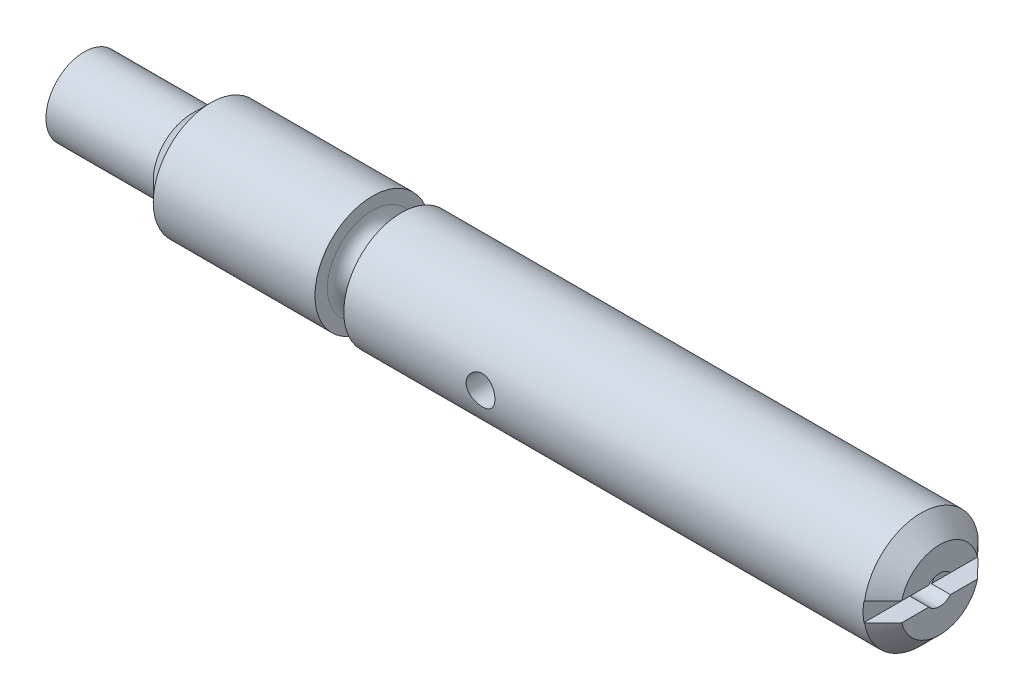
ISO-10303-21;
HEADER;
FILE_DESCRIPTION(('STEP AP214'),'2;1');
FILE_NAME('part.step','',(''),(''),'','','');
FILE_SCHEMA(('AUTOMOTIVE_DESIGN { 1 0 10303 214 1 1 1 1 }'));
ENDSEC;
DATA;
#1=APPLICATION_CONTEXT('core data for automotive mechanical design processes');
#2=APPLICATION_PROTOCOL_DEFINITION('international standard','automotive_design',2000,#1);
#3=PRODUCT_CONTEXT('',#1,'mechanical');
#4=PRODUCT('Part','Part','',(#3));
#5=PRODUCT_RELATED_PRODUCT_CATEGORY('part','',(#4));
#6=PRODUCT_DEFINITION_FORMATION('','',#4);
#7=PRODUCT_DEFINITION_CONTEXT('part definition',#1,'design');
#8=PRODUCT_DEFINITION('design','',#6,#7);
#9=PRODUCT_DEFINITION_SHAPE('','',#8);
#10=(LENGTH_UNIT() NAMED_UNIT(*) SI_UNIT(.MILLI.,.METRE.));
#11=(NAMED_UNIT(*) PLANE_ANGLE_UNIT() SI_UNIT($,.RADIAN.));
#12=(NAMED_UNIT(*) SI_UNIT($,.STERADIAN.) SOLID_ANGLE_UNIT());
#13=UNCERTAINTY_MEASURE_WITH_UNIT(LENGTH_MEASURE(1.E-05),#10,'distance_accuracy_value','');
#14=(GEOMETRIC_REPRESENTATION_CONTEXT(3) GLOBAL_UNCERTAINTY_ASSIGNED_CONTEXT((#13)) GLOBAL_UNIT_ASSIGNED_CONTEXT((#10,
#11,#12)) REPRESENTATION_CONTEXT('',''));
#15=CARTESIAN_POINT('',(0.,0.,0.));
#16=DIRECTION('',(0.,0.,1.));
#17=DIRECTION('',(1.,0.,0.));
#18=AXIS2_PLACEMENT_3D('',#15,#16,#17);
#19=CARTESIAN_POINT('',(71.628,0.,0.));
#20=DIRECTION('',(-1.,0.,0.));
#21=DIRECTION('',(0.,0.,1.));
#22=AXIS2_PLACEMENT_3D('',#19,#20,#21);
#23=CYLINDRICAL_SURFACE('',#22,4.7625);
#24=CARTESIAN_POINT('',(70.0532,0.,0.));
#25=DIRECTION('',(-1.,0.,0.));
#26=DIRECTION('',(0.,0.,1.));
#27=AXIS2_PLACEMENT_3D('',#24,#25,#26);
#28=CIRCLE('',#27,4.7625);
#29=CARTESIAN_POINT('',(70.0532,0.7874,-4.69695725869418));
#30=VERTEX_POINT('',#29);
#31=CARTESIAN_POINT('',(70.0532,-0.7874,-4.69695725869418));
#32=VERTEX_POINT('',#31);
#33=EDGE_CURVE('E594',#30,#32,#28,.T.);
#34=ORIENTED_EDGE('',*,*,#33,.T.);
#35=DIRECTION('',(-1.,0.,0.));
#36=VECTOR('',#35,1.);
#37=CARTESIAN_POINT('',(71.628,-0.7874,-4.69695725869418));
#38=LINE('',#37,#36);
#39=CARTESIAN_POINT('',(70.104,-0.7874,-4.6969572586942));
#40=VERTEX_POINT('',#39);
#41=EDGE_CURVE('E584',#32,#40,#38,.F.);
#42=ORIENTED_EDGE('',*,*,#41,.T.);
#43=CARTESIAN_POINT('',(70.104,0.,0.));
#44=DIRECTION('',(1.,0.,0.));
#45=DIRECTION('',(0.,0.,-1.));
#46=AXIS2_PLACEMENT_3D('',#43,#44,#45);
#47=CIRCLE('',#46,4.7625);
#48=CARTESIAN_POINT('',(70.104,-0.7874,4.69695725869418));
#49=VERTEX_POINT('',#48);
#50=EDGE_CURVE('E519',#40,#49,#47,.F.);
#51=ORIENTED_EDGE('',*,*,#50,.T.);
#52=DIRECTION('',(-1.,0.,0.));
#53=VECTOR('',#52,1.);
#54=CARTESIAN_POINT('',(71.628,-0.7874,4.69695725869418));
#55=LINE('',#54,#53);
#56=CARTESIAN_POINT('',(70.0532,-0.7874,4.69695725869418));
#57=VERTEX_POINT('',#56);
#58=EDGE_CURVE('E569',#49,#57,#55,.T.);
#59=ORIENTED_EDGE('',*,*,#58,.T.);
#60=CARTESIAN_POINT('',(70.0532,0.7874,4.69695725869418));
#61=VERTEX_POINT('',#60);
#62=EDGE_CURVE('E580',#57,#61,#28,.T.);
#63=ORIENTED_EDGE('',*,*,#62,.T.);
#64=DIRECTION('',(-1.,0.,0.));
#65=VECTOR('',#64,1.);
#66=CARTESIAN_POINT('',(71.628,0.7874,4.69695725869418));
#67=LINE('',#66,#65);
#68=CARTESIAN_POINT('',(70.104,0.7874,4.69695725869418));
#69=VERTEX_POINT('',#68);
#70=EDGE_CURVE('E617',#69,#61,#67,.T.);
#71=ORIENTED_EDGE('',*,*,#70,.F.);
#72=CARTESIAN_POINT('',(70.104,0.7874,-4.69695725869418));
#73=VERTEX_POINT('',#72);
#74=EDGE_CURVE('E515',#69,#73,#47,.F.);
#75=ORIENTED_EDGE('',*,*,#74,.T.);
#76=DIRECTION('',(-1.,0.,0.));
#77=VECTOR('',#76,1.);
#78=CARTESIAN_POINT('',(71.628,0.7874,-4.69695725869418));
#79=LINE('',#78,#77);
#80=EDGE_CURVE('E602',#30,#73,#79,.F.);
#81=ORIENTED_EDGE('',*,*,#80,.F.);
#82=EDGE_LOOP('',(#34,#42,#51,#59,#63,#71,#75,#81));
#83=FACE_BOUND('',#82,.T.);
#84=CARTESIAN_POINT('',(27.0256,0.,0.));
#85=DIRECTION('',(1.,0.,0.));
#86=DIRECTION('',(0.,0.,-1.));
#87=AXIS2_PLACEMENT_3D('',#84,#85,#86);
#88=CIRCLE('',#87,4.7625);
#89=CARTESIAN_POINT('',(27.0256,0.,-4.7625));
#90=VERTEX_POINT('',#89);
#91=EDGE_CURVE('E627',#90,#90,#88,.T.);
#92=ORIENTED_EDGE('',*,*,#91,.T.);
#93=EDGE_LOOP('',(#92));
#94=FACE_BOUND('',#93,.T.);
#95=CARTESIAN_POINT('',(39.5478,0.,4.7625));
#96=CARTESIAN_POINT('',(39.5477981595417,0.0659525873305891,4.762498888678));
#97=CARTESIAN_POINT('',(39.5423161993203,0.131925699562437,4.76111635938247));
#98=CARTESIAN_POINT('',(39.5205662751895,0.261980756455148,4.7557351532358));
#99=CARTESIAN_POINT('',(39.5042922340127,0.326061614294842,4.75173500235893));
#100=CARTESIAN_POINT('',(39.4615134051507,0.450435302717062,4.74156145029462));
#101=CARTESIAN_POINT('',(39.4350209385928,0.510732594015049,4.73539066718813));
#102=CARTESIAN_POINT('',(39.3726007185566,0.626027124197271,4.72153284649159));
#103=CARTESIAN_POINT('',(39.3366726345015,0.681024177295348,4.71384575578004));
#104=CARTESIAN_POINT('',(39.2556156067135,0.785295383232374,4.6976117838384));
#105=CARTESIAN_POINT('',(39.2103281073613,0.834444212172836,4.68905158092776));
#106=CARTESIAN_POINT('',(39.1121772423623,0.924534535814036,4.67212456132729));
#107=CARTESIAN_POINT('',(39.059313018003,0.965475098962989,4.66375776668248));
#108=CARTESIAN_POINT('',(38.9465351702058,1.03857699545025,4.64803049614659));
#109=CARTESIAN_POINT('',(38.8865280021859,1.07059798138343,4.64068692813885));
#110=CARTESIAN_POINT('',(38.7617686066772,1.12404915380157,4.62803191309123));
#111=CARTESIAN_POINT('',(38.6970171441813,1.14548104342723,4.62272013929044));
#112=CARTESIAN_POINT('',(38.565985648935,1.1767178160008,4.61486707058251));
#113=CARTESIAN_POINT('',(38.4997626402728,1.18674810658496,4.61227214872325));
#114=CARTESIAN_POINT('',(38.3665269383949,1.19559909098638,4.60998608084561));
#115=CARTESIAN_POINT('',(38.2995143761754,1.19442161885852,4.6102944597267));
#116=CARTESIAN_POINT('',(38.1683306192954,1.18107031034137,4.61373195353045));
#117=CARTESIAN_POINT('',(38.1041299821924,1.16916523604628,4.61679212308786));
#118=CARTESIAN_POINT('',(37.9786675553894,1.13512546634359,4.62527849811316));
#119=CARTESIAN_POINT('',(37.9174059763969,1.11299003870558,4.63070487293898));
#120=CARTESIAN_POINT('',(37.798840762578,1.05888925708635,4.64337542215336));
#121=CARTESIAN_POINT('',(37.7415835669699,1.02682649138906,4.65063747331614));
#122=CARTESIAN_POINT('',(37.6331658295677,0.953849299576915,4.66615105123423));
#123=CARTESIAN_POINT('',(37.582006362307,0.912933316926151,4.67440275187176));
#124=CARTESIAN_POINT('',(37.4856963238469,0.822019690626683,4.69125603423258));
#125=CARTESIAN_POINT('',(37.4407601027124,0.771795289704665,4.69986086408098));
#126=CARTESIAN_POINT('',(37.3599071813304,0.664420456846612,4.71623754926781));
#127=CARTESIAN_POINT('',(37.3239907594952,0.607269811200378,4.72400937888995));
#128=CARTESIAN_POINT('',(37.2621176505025,0.487357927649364,4.73788340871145));
#129=CARTESIAN_POINT('',(37.2361959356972,0.424577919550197,4.74397972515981));
#130=CARTESIAN_POINT('',(37.1953338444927,0.295364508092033,4.75377305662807));
#131=CARTESIAN_POINT('',(37.1803913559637,0.228931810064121,4.75747053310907));
#132=CARTESIAN_POINT('',(37.1622395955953,0.0961313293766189,4.76198123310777));
#133=CARTESIAN_POINT('',(37.1587384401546,0.0298058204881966,4.76286619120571));
#134=CARTESIAN_POINT('',(37.1627679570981,-0.102483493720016,4.7618565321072));
#135=CARTESIAN_POINT('',(37.1702976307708,-0.168447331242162,4.75996216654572));
#136=CARTESIAN_POINT('',(37.1959345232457,-0.297125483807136,4.75365269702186));
#137=CARTESIAN_POINT('',(37.2138823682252,-0.359873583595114,4.74927559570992));
#138=CARTESIAN_POINT('',(37.2596639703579,-0.481464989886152,4.73849413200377));
#139=CARTESIAN_POINT('',(37.2874987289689,-0.540307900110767,4.73208956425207));
#140=CARTESIAN_POINT('',(37.3528287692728,-0.653578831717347,4.7177919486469));
#141=CARTESIAN_POINT('',(37.3904873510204,-0.707909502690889,4.70987441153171));
#142=CARTESIAN_POINT('',(37.4741874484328,-0.809583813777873,4.69346749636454));
#143=CARTESIAN_POINT('',(37.520230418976,-0.856926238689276,4.68497801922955));
#144=CARTESIAN_POINT('',(37.6207477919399,-0.944484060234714,4.66812560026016));
#145=CARTESIAN_POINT('',(37.6754022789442,-0.984494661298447,4.65977095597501));
#146=CARTESIAN_POINT('',(37.7908217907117,-1.0547763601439,4.6443678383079));
#147=CARTESIAN_POINT('',(37.8515865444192,-1.08504788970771,4.63731930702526));
#148=CARTESIAN_POINT('',(37.977176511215,-1.13476659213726,4.62540430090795));
#149=CARTESIAN_POINT('',(38.0419750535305,-1.15427788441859,4.62052493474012));
#150=CARTESIAN_POINT('',(38.1740738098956,-1.1820906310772,4.61348866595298));
#151=CARTESIAN_POINT('',(38.2413734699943,-1.19039455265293,4.61133116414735));
#152=CARTESIAN_POINT('',(38.3744795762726,-1.19542741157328,4.61002874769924));
#153=CARTESIAN_POINT('',(38.4402730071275,-1.19248374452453,4.61079861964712));
#154=CARTESIAN_POINT('',(38.5703932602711,-1.1758546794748,4.61506709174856));
#155=CARTESIAN_POINT('',(38.6347201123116,-1.16216949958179,4.61856563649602));
#156=CARTESIAN_POINT('',(38.7597230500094,-1.12462513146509,4.62784963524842));
#157=CARTESIAN_POINT('',(38.8204187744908,-1.10082765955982,4.63362120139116));
#158=CARTESIAN_POINT('',(38.9369995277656,-1.04378302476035,4.64680281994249));
#159=CARTESIAN_POINT('',(38.9928838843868,-1.0105345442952,4.65421310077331));
#160=CARTESIAN_POINT('',(39.0998368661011,-0.934506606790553,4.67007994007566));
#161=CARTESIAN_POINT('',(39.1507408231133,-0.891500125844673,4.67855883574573));
#162=CARTESIAN_POINT('',(39.2447159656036,-0.797618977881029,4.69547453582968));
#163=CARTESIAN_POINT('',(39.287785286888,-0.74674244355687,4.70391132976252));
#164=CARTESIAN_POINT('',(39.3656345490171,-0.637445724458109,4.71997581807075));
#165=CARTESIAN_POINT('',(39.4002490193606,-0.57890490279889,4.72758595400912));
#166=CARTESIAN_POINT('',(39.4590902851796,-0.456649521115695,4.74095416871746));
#167=CARTESIAN_POINT('',(39.483324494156,-0.392938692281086,4.74671356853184));
#168=CARTESIAN_POINT('',(39.5171369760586,-0.274455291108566,4.75488407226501));
#169=CARTESIAN_POINT('',(39.5286106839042,-0.220245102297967,4.75772038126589));
#170=CARTESIAN_POINT('',(39.5439426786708,-0.110694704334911,4.76152874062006));
#171=CARTESIAN_POINT('',(39.5478015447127,-0.0553545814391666,4.76250093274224));
#172=CARTESIAN_POINT('',(39.5478,0.,4.7625));
#173=B_SPLINE_CURVE_WITH_KNOTS('',3,(#95,#96,#97,#98,#99,#100,#101,#102,#103,#104,#105,#106,
#107,#108,#109,#110,#111,#112,#113,#114,#115,#116,#117,#118,#119,#120,#121,#122,#123,#124,#125,
#126,#127,#128,#129,#130,#131,#132,#133,#134,#135,#136,#137,#138,#139,#140,#141,#142,#143,#144,
#145,#146,#147,#148,#149,#150,#151,#152,#153,#154,#155,#156,#157,#158,#159,#160,#161,#162,#163,
#164,#165,#166,#167,#168,#169,#170,#171,#172),.UNSPECIFIED.,.T.,.F.,(4,2,2,2,2,2,2,2,2,2,2,2,2,
2,2,2,2,2,2,2,2,2,2,2,2,2,2,2,2,2,2,2,2,2,2,2,2,2,4),(0.,0.197654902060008,0.395421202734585,
0.592949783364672,0.790485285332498,0.991691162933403,1.19291986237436,1.39715587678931,
1.60135903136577,1.80145080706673,2.00150984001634,2.19669196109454,2.39188805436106,
2.58906369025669,2.78627402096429,2.98913889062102,3.19201002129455,3.3955847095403,
3.59912022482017,3.79742099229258,3.99570380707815,4.19103043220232,4.38637684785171,
4.58520407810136,4.78406584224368,4.98783686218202,5.19159884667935,5.39413313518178,
5.59662283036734,5.7932639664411,5.9899011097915,6.18535501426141,6.3808361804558,
6.58144235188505,6.78209619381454,6.98640880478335,7.19057525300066,7.35648135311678,
7.52237483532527),.UNSPECIFIED.);
#174=CARTESIAN_POINT('',(39.5478,0.,4.7625));
#175=VERTEX_POINT('',#174);
#176=EDGE_CURVE('E655',#175,#175,#173,.T.);
#177=ORIENTED_EDGE('',*,*,#176,.F.);
#178=EDGE_LOOP('',(#177));
#179=FACE_BOUND('',#178,.T.);
#180=ADVANCED_FACE('F381',(#83,#94,#179),#23,.T.);
#181=CARTESIAN_POINT('',(71.628,0.,0.));
#182=DIRECTION('',(1.,0.,0.));
#183=DIRECTION('',(0.,0.,-1.));
#184=AXIS2_PLACEMENT_3D('',#181,#182,#183);
#185=CYLINDRICAL_SURFACE('',#184,1.19379999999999);
#186=CARTESIAN_POINT('',(34.798,0.,0.));
#187=DIRECTION('',(1.,0.,0.));
#188=DIRECTION('',(0.,0.,-1.));
#189=AXIS2_PLACEMENT_3D('',#186,#187,#188);
#190=CIRCLE('',#189,1.19379999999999);
#191=CARTESIAN_POINT('',(34.798,0.,-1.19379999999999));
#192=VERTEX_POINT('',#191);
#193=EDGE_CURVE('E595',#192,#192,#190,.T.);
#194=ORIENTED_EDGE('',*,*,#193,.F.);
#195=EDGE_LOOP('',(#194));
#196=FACE_BOUND('',#195,.T.);
#197=CARTESIAN_POINT('',(71.628,0.,0.));
#198=DIRECTION('',(1.,0.,0.));
#199=DIRECTION('',(0.,0.,-1.));
#200=AXIS2_PLACEMENT_3D('',#197,#198,#199);
#201=CIRCLE('',#200,1.1938);
#202=CARTESIAN_POINT('',(71.628,-0.7874,0.8973069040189));
#203=VERTEX_POINT('',#202);
#204=CARTESIAN_POINT('',(71.628,-0.7874,-0.8973069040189));
#205=VERTEX_POINT('',#204);
#206=EDGE_CURVE('E597',#203,#205,#201,.T.);
#207=ORIENTED_EDGE('',*,*,#206,.T.);
#208=DIRECTION('',(1.,0.,0.));
#209=VECTOR('',#208,1.);
#210=CARTESIAN_POINT('',(71.628,-0.7874,-0.8973069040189));
#211=LINE('',#210,#209);
#212=CARTESIAN_POINT('',(70.0532,-0.7874,-0.8973069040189));
#213=VERTEX_POINT('',#212);
#214=EDGE_CURVE('E586',#205,#213,#211,.F.);
#215=ORIENTED_EDGE('',*,*,#214,.T.);
#216=CARTESIAN_POINT('',(70.0532,0.,0.));
#217=DIRECTION('',(-1.,0.,0.));
#218=DIRECTION('',(0.,0.,1.));
#219=AXIS2_PLACEMENT_3D('',#216,#217,#218);
#220=CIRCLE('',#219,1.19379999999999);
#221=CARTESIAN_POINT('',(70.0532,0.7874,-0.8973069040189));
#222=VERTEX_POINT('',#221);
#223=EDGE_CURVE('E610',#213,#222,#220,.F.);
#224=ORIENTED_EDGE('',*,*,#223,.T.);
#225=DIRECTION('',(1.,0.,0.));
#226=VECTOR('',#225,1.);
#227=CARTESIAN_POINT('',(71.628,0.7874,-0.8973069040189));
#228=LINE('',#227,#226);
#229=CARTESIAN_POINT('',(71.628,0.7874,-0.8973069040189));
#230=VERTEX_POINT('',#229);
#231=EDGE_CURVE('E588',#230,#222,#228,.F.);
#232=ORIENTED_EDGE('',*,*,#231,.F.);
#233=CARTESIAN_POINT('',(71.628,0.7874,0.8973069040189));
#234=VERTEX_POINT('',#233);
#235=EDGE_CURVE('E522',#230,#234,#201,.T.);
#236=ORIENTED_EDGE('',*,*,#235,.T.);
#237=DIRECTION('',(1.,0.,0.));
#238=VECTOR('',#237,1.);
#239=CARTESIAN_POINT('',(71.628,0.7874,0.8973069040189));
#240=LINE('',#239,#238);
#241=CARTESIAN_POINT('',(70.0532,0.7874,0.8973069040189));
#242=VERTEX_POINT('',#241);
#243=EDGE_CURVE('E619',#242,#234,#240,.T.);
#244=ORIENTED_EDGE('',*,*,#243,.F.);
#245=CARTESIAN_POINT('',(70.0532,-0.7874,0.8973069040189));
#246=VERTEX_POINT('',#245);
#247=EDGE_CURVE('E622',#242,#246,#220,.F.);
#248=ORIENTED_EDGE('',*,*,#247,.T.);
#249=DIRECTION('',(1.,0.,0.));
#250=VECTOR('',#249,1.);
#251=CARTESIAN_POINT('',(71.628,-0.7874,0.8973069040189));
#252=LINE('',#251,#250);
#253=EDGE_CURVE('E572',#246,#203,#252,.T.);
#254=ORIENTED_EDGE('',*,*,#253,.T.);
#255=EDGE_LOOP('',(#207,#215,#224,#232,#236,#244,#248,#254));
#256=FACE_BOUND('',#255,.T.);
#257=CARTESIAN_POINT('',(38.354,0.,0.));
#258=DIRECTION('',(0.707106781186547,0.,-0.707106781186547));
#259=DIRECTION('',(0.707106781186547,0.,0.707106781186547));
#260=AXIS2_PLACEMENT_3D('',#257,#258,#259);
#261=ELLIPSE('',#260,1.688288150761,1.1938);
#262=CARTESIAN_POINT('',(38.354,1.19379999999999,0.));
#263=VERTEX_POINT('',#262);
#264=CARTESIAN_POINT('',(38.354,-1.19379999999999,0.));
#265=VERTEX_POINT('',#264);
#266=EDGE_CURVE('E11',#263,#265,#261,.T.);
#267=ORIENTED_EDGE('',*,*,#266,.F.);
#268=CARTESIAN_POINT('',(38.354,0.,0.));
#269=DIRECTION('',(0.707106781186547,0.,0.707106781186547));
#270=DIRECTION('',(0.707106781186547,0.,-0.707106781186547));
#271=AXIS2_PLACEMENT_3D('',#268,#269,#270);
#272=ELLIPSE('',#271,1.688288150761,1.1938);
#273=EDGE_CURVE('E389',#265,#263,#272,.F.);
#274=ORIENTED_EDGE('',*,*,#273,.F.);
#275=EDGE_LOOP('',(#267,#274));
#276=FACE_BOUND('',#275,.T.);
#277=ADVANCED_FACE('F466',(#196,#256,#276),#185,.F.);
#278=CARTESIAN_POINT('',(24.638,0.,0.));
#279=DIRECTION('',(-1.,0.,0.));
#280=DIRECTION('',(0.,0.,1.));
#281=AXIS2_PLACEMENT_3D('',#278,#279,#280);
#282=CIRCLE('',#281,4.7625);
#283=CARTESIAN_POINT('',(24.638,0.,4.7625));
#284=VERTEX_POINT('',#283);
#285=EDGE_CURVE('E630',#284,#284,#282,.T.);
#286=ORIENTED_EDGE('',*,*,#285,.T.);
#287=EDGE_LOOP('',(#286));
#288=FACE_BOUND('',#287,.T.);
#289=CARTESIAN_POINT('',(11.2395,0.,0.));
#290=DIRECTION('',(1.,0.,0.));
#291=DIRECTION('',(0.,0.,-1.));
#292=AXIS2_PLACEMENT_3D('',#289,#290,#291);
#293=CIRCLE('',#292,4.7625);
#294=CARTESIAN_POINT('',(11.2395,0.,-4.7625));
#295=VERTEX_POINT('',#294);
#296=EDGE_CURVE('E635',#295,#295,#293,.F.);
#297=ORIENTED_EDGE('',*,*,#296,.F.);
#298=EDGE_LOOP('',(#297));
#299=FACE_BOUND('',#298,.T.);
#300=ADVANCED_FACE('F468',(#288,#299),#23,.T.);
#301=CARTESIAN_POINT('',(71.628,0.,0.));
#302=DIRECTION('',(1.,0.,0.));
#303=DIRECTION('',(0.,0.,-1.));
#304=AXIS2_PLACEMENT_3D('',#301,#302,#303);
#305=PLANE('',#304);
#306=CARTESIAN_POINT('',(71.628,0.,0.));
#307=DIRECTION('',(1.,0.,0.));
#308=DIRECTION('',(0.,0.,-1.));
#309=AXIS2_PLACEMENT_3D('',#306,#307,#308);
#310=CIRCLE('',#309,3.2385);
#311=CARTESIAN_POINT('',(71.628,0.7874,-3.14131875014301));
#312=VERTEX_POINT('',#311);
#313=CARTESIAN_POINT('',(71.628,0.7874,3.14131875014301));
#314=VERTEX_POINT('',#313);
#315=EDGE_CURVE('E510',#312,#314,#310,.T.);
#316=ORIENTED_EDGE('',*,*,#315,.T.);
#317=DIRECTION('',(0.,0.,-1.));
#318=VECTOR('',#317,1.);
#319=CARTESIAN_POINT('',(71.628,0.7874,4.7625));
#320=LINE('',#319,#318);
#321=EDGE_CURVE('E401',#314,#234,#320,.T.);
#322=ORIENTED_EDGE('',*,*,#321,.T.);
#323=ORIENTED_EDGE('',*,*,#235,.F.);
#324=EDGE_CURVE('E513',#230,#312,#320,.T.);
#325=ORIENTED_EDGE('',*,*,#324,.T.);
#326=EDGE_LOOP('',(#316,#322,#323,#325));
#327=FACE_BOUND('',#326,.T.);
#328=ADVANCED_FACE('F476',(#327),#305,.T.);
#329=CARTESIAN_POINT('',(71.628,0.,0.));
#330=DIRECTION('',(-1.,0.,0.));
#331=DIRECTION('',(0.,0.,1.));
#332=AXIS2_PLACEMENT_3D('',#329,#330,#331);
#333=CONICAL_SURFACE('',#332,3.2385,0.785398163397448);
#334=ORIENTED_EDGE('',*,*,#74,.F.);
#335=CARTESIAN_POINT('',(64.3161102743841,0.7874,10.5209659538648));
#336=CARTESIAN_POINT('',(64.6872551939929,0.7874,10.1487740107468));
#337=CARTESIAN_POINT('',(65.0583536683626,0.7874,9.77653570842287));
#338=CARTESIAN_POINT('',(65.8004071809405,0.7874,9.03189082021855));
#339=CARTESIAN_POINT('',(66.1713622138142,0.7874,8.65948422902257));
#340=CARTESIAN_POINT('',(66.9133613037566,0.7874,7.91414285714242));
#341=CARTESIAN_POINT('',(67.2844051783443,0.7874,7.54120789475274));
#342=CARTESIAN_POINT('',(68.0261402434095,0.7874,6.79501200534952));
#343=CARTESIAN_POINT('',(68.3968314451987,0.7874,6.4217510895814));
#344=CARTESIAN_POINT('',(69.1223974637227,0.7874,5.69006996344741));
#345=CARTESIAN_POINT('',(69.4772946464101,0.7874,5.33167195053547));
#346=CARTESIAN_POINT('',(70.0089651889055,0.7874,4.79337198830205));
#347=CARTESIAN_POINT('',(70.1860850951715,0.7874,4.613812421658));
#348=CARTESIAN_POINT('',(70.5399927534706,0.7874,4.25436955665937));
#349=CARTESIAN_POINT('',(70.7167805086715,0.7874,4.07448626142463));
#350=CARTESIAN_POINT('',(71.0697857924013,0.7874,3.71433993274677));
#351=CARTESIAN_POINT('',(71.2460035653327,0.7874,3.53407713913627));
#352=CARTESIAN_POINT('',(71.5976983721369,0.7874,3.17281728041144));
#353=CARTESIAN_POINT('',(71.7731753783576,0.7874,2.9918201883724));
#354=CARTESIAN_POINT('',(72.122876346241,0.7874,2.62867535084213));
#355=CARTESIAN_POINT('',(72.2971005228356,0.7874,2.4465278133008));
#356=CARTESIAN_POINT('',(72.556686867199,0.7874,2.17166253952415));
#357=CARTESIAN_POINT('',(72.6429214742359,0.7874,2.07976952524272));
#358=CARTESIAN_POINT('',(72.8145340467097,0.7874,1.89518777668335));
#359=CARTESIAN_POINT('',(72.8999120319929,0.7874,1.80249906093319));
#360=CARTESIAN_POINT('',(73.0081387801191,0.7874,1.68333665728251));
#361=CARTESIAN_POINT('',(73.0315922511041,0.7874,1.65741205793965));
#362=CARTESIAN_POINT('',(73.078382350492,0.7874,1.60545753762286));
#363=CARTESIAN_POINT('',(73.1017189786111,0.7874,1.57942761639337));
#364=CARTESIAN_POINT('',(73.1715344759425,0.7874,1.50115544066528));
#365=CARTESIAN_POINT('',(73.2178146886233,0.7874,1.44873546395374));
#366=CARTESIAN_POINT('',(73.309975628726,0.7874,1.34292606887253));
#367=CARTESIAN_POINT('',(73.3558516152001,0.7874,1.28953251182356));
#368=CARTESIAN_POINT('',(73.4466047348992,0.7874,1.18192273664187));
#369=CARTESIAN_POINT('',(73.4914821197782,0.7874,1.12770673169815));
#370=CARTESIAN_POINT('',(73.580163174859,0.7874,1.01771023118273));
#371=CARTESIAN_POINT('',(73.6239559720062,0.7874,0.961920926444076));
#372=CARTESIAN_POINT('',(73.7093784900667,0.7874,0.848714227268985));
#373=CARTESIAN_POINT('',(73.751008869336,0.7874,0.791297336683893));
#374=CARTESIAN_POINT('',(73.8306413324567,0.7874,0.674414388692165));
#375=CARTESIAN_POINT('',(73.8686610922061,0.7874,0.614960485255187));
#376=CARTESIAN_POINT('',(73.9389627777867,0.7874,0.492775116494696));
#377=CARTESIAN_POINT('',(73.9712595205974,0.7874,0.430052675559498));
#378=CARTESIAN_POINT('',(74.008740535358,0.7874,0.340922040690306));
#379=CARTESIAN_POINT('',(74.018244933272,0.7874,0.316347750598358));
#380=CARTESIAN_POINT('',(74.0355213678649,0.7874,0.266602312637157));
#381=CARTESIAN_POINT('',(74.0432933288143,0.7874,0.241431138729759));
#382=CARTESIAN_POINT('',(74.0634094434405,0.7874,0.16527433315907));
#383=CARTESIAN_POINT('',(74.0726732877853,0.7874,0.113379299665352));
#384=CARTESIAN_POINT('',(74.0787835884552,0.7874,0.0346928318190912));
#385=CARTESIAN_POINT('',(74.0795037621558,0.7874,0.00816639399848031));
#386=CARTESIAN_POINT('',(74.0782696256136,0.7874,-0.0448248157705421));
#387=CARTESIAN_POINT('',(74.0763153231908,0.7874,-0.0712895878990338));
#388=CARTESIAN_POINT('',(74.0665776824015,0.7874,-0.150336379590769));
#389=CARTESIAN_POINT('',(74.0549118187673,0.7874,-0.202461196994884));
#390=CARTESIAN_POINT('',(74.0279119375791,0.7874,-0.29072685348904));
#391=CARTESIAN_POINT('',(74.0143547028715,0.7874,-0.327460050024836));
#392=CARTESIAN_POINT('',(73.984097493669,0.7874,-0.399630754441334));
#393=CARTESIAN_POINT('',(73.9673952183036,0.7874,-0.435067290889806));
#394=CARTESIAN_POINT('',(73.9316095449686,0.7874,-0.504902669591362));
#395=CARTESIAN_POINT('',(73.9125153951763,0.7874,-0.539295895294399));
#396=CARTESIAN_POINT('',(73.8726339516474,0.7874,-0.60705794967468));
#397=CARTESIAN_POINT('',(73.8518473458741,0.7874,-0.640427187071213));
#398=CARTESIAN_POINT('',(73.8050000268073,0.7874,-0.712509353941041));
#399=CARTESIAN_POINT('',(73.7786805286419,0.7874,-0.751052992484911));
#400=CARTESIAN_POINT('',(73.7247513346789,0.7874,-0.827230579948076));
#401=CARTESIAN_POINT('',(73.6971413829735,0.7874,-0.864864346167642));
#402=CARTESIAN_POINT('',(73.6128609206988,0.7874,-0.976751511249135));
#403=CARTESIAN_POINT('',(73.5547766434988,0.7874,-1.04993635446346));
#404=CARTESIAN_POINT('',(73.4362779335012,0.7874,-1.19467264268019));
#405=CARTESIAN_POINT('',(73.3758580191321,0.7874,-1.26621952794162));
#406=CARTESIAN_POINT('',(73.2536306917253,0.7874,-1.40806304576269));
#407=CARTESIAN_POINT('',(73.1918238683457,0.7874,-1.47836018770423));
#408=CARTESIAN_POINT('',(73.0671269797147,0.7874,-1.61825448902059));
#409=CARTESIAN_POINT('',(73.0042348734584,0.7874,-1.68784982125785));
#410=CARTESIAN_POINT('',(72.8777697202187,0.7874,-1.82643112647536));
#411=CARTESIAN_POINT('',(72.8141966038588,0.7874,-1.89541703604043));
#412=CARTESIAN_POINT('',(72.6866582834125,0.7874,-2.03282140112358));
#413=CARTESIAN_POINT('',(72.6226938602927,0.7874,-2.10124058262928));
#414=CARTESIAN_POINT('',(72.4943954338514,0.7874,-2.23772664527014));
#415=CARTESIAN_POINT('',(72.4300614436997,0.7874,-2.30579353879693));
#416=CARTESIAN_POINT('',(72.2378718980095,0.7874,-2.50828590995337));
#417=CARTESIAN_POINT('',(72.109601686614,0.7874,-2.64231765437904));
#418=CARTESIAN_POINT('',(71.8523560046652,0.7874,-2.90970308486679));
#419=CARTESIAN_POINT('',(71.7233805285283,0.7874,-3.04305676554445));
#420=CARTESIAN_POINT('',(71.3357432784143,0.7874,-3.44244433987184));
#421=CARTESIAN_POINT('',(71.0763790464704,0.7874,-3.70779602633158));
#422=CARTESIAN_POINT('',(70.5565336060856,0.7874,-4.23773226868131));
#423=CARTESIAN_POINT('',(70.2960517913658,0.7874,-4.50231622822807));
#424=CARTESIAN_POINT('',(69.774520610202,0.7874,-5.03091575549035));
#425=CARTESIAN_POINT('',(69.5134712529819,0.7874,-5.29493133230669));
#426=CARTESIAN_POINT('',(68.9916857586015,0.7874,-5.82192358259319));
#427=CARTESIAN_POINT('',(68.7309505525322,0.7874,-6.08490117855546));
#428=CARTESIAN_POINT('',(68.2092343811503,0.7874,-6.61061465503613));
#429=CARTESIAN_POINT('',(67.9482534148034,0.7874,-6.87335053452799));
#430=CARTESIAN_POINT('',(67.1651436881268,0.7874,-7.66121736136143));
#431=CARTESIAN_POINT('',(66.6427607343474,0.7874,-8.18609562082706));
#432=CARTESIAN_POINT('',(65.969981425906,0.7874,-8.86161472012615));
#433=CARTESIAN_POINT('',(65.8197538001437,0.7874,-9.01242371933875));
#434=CARTESIAN_POINT('',(65.5192664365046,0.7874,-9.31401882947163));
#435=CARTESIAN_POINT('',(65.369006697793,0.7874,-9.46480493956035));
#436=CARTESIAN_POINT('',(65.0683170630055,0.7874,-9.76650095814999));
#437=CARTESIAN_POINT('',(64.9178871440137,0.7874,-9.91741084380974));
#438=CARTESIAN_POINT('',(64.6170112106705,0.7874,-10.2192054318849));
#439=CARTESIAN_POINT('',(64.4665651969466,0.7874,-10.3700901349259));
#440=CARTESIAN_POINT('',(64.3161102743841,0.7874,-10.5209659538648));
#441=B_SPLINE_CURVE_WITH_KNOTS('',3,(#335,#336,#337,#338,#339,#340,#341,#342,#343,#344,#345,
#346,#347,#348,#349,#350,#351,#352,#353,#354,#355,#356,#357,#358,#359,#360,#361,#362,#363,#364,
#365,#366,#367,#368,#369,#370,#371,#372,#373,#374,#375,#376,#377,#378,#379,#380,#381,#382,#383,
#384,#385,#386,#387,#388,#389,#390,#391,#392,#393,#394,#395,#396,#397,#398,#399,#400,#401,#402,
#403,#404,#405,#406,#407,#408,#409,#410,#411,#412,#413,#414,#415,#416,#417,#418,#419,#420,#421,
#422,#423,#424,#425,#426,#427,#428,#429,#430,#431,#432,#433,#434,#435,#436,#437,#438,#439,#440),
.UNSPECIFIED.,.F.,.F.,(4,2,2,2,2,2,2,2,2,2,2,2,2,2,2,2,2,2,2,2,2,2,2,2,2,2,2,2,2,2,2,2,2,2,2,2,
2,2,2,2,2,2,2,2,2,2,2,2,2,2,2,2,4),(0.,1.57685721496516,3.15376831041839,4.73199069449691,
6.31016062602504,7.82330534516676,8.57995415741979,9.33659571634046,10.0928522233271,
10.8491367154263,11.6052882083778,11.9833416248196,12.3613862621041,12.4662637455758,
12.5711414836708,12.7809159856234,12.9920932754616,13.2032167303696,13.4159592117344,
13.6286365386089,13.8402123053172,14.0512320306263,14.1302174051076,14.2092062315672,
14.3663171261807,14.4458037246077,14.5252900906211,14.6845866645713,14.801904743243,
14.9193089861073,15.0372613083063,15.1551659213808,15.2951462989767,15.4351545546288,
15.715367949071,15.9962845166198,16.277083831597,16.5584860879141,16.8399172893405,
17.120902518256,17.4018777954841,17.9584336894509,18.5149939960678,19.6281508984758,
20.7420168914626,21.8558649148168,22.9668375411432,24.0778148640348,26.2993972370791,
26.937993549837,27.5766092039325,28.215848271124,28.8550679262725),.UNSPECIFIED.);
#442=EDGE_CURVE('E532',#69,#314,#441,.T.);
#443=ORIENTED_EDGE('',*,*,#442,.T.);
#444=ORIENTED_EDGE('',*,*,#315,.F.);
#445=EDGE_CURVE('E526',#312,#73,#441,.T.);
#446=ORIENTED_EDGE('',*,*,#445,.T.);
#447=EDGE_LOOP('',(#334,#443,#444,#446));
#448=FACE_BOUND('',#447,.T.);
#449=ADVANCED_FACE('F492',(#448),#333,.T.);
#450=DIRECTION('',(0.,0.,-1.));
#451=VECTOR('',#450,1.);
#452=CARTESIAN_POINT('',(71.628,-0.7874,4.7625));
#453=LINE('',#452,#451);
#454=CARTESIAN_POINT('',(71.628,-0.7874,3.14131875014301));
#455=VERTEX_POINT('',#454);
#456=EDGE_CURVE('E666',#455,#203,#453,.T.);
#457=ORIENTED_EDGE('',*,*,#456,.F.);
#458=CARTESIAN_POINT('',(71.628,-0.7874,-3.14131875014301));
#459=VERTEX_POINT('',#458);
#460=EDGE_CURVE('E516',#455,#459,#310,.T.);
#461=ORIENTED_EDGE('',*,*,#460,.T.);
#462=EDGE_CURVE('E634',#205,#459,#453,.T.);
#463=ORIENTED_EDGE('',*,*,#462,.F.);
#464=ORIENTED_EDGE('',*,*,#206,.F.);
#465=EDGE_LOOP('',(#457,#461,#463,#464));
#466=FACE_BOUND('',#465,.T.);
#467=ADVANCED_FACE('F490',(#466),#305,.T.);
#468=CARTESIAN_POINT('',(34.798,0.,0.));
#469=DIRECTION('',(1.,0.,0.));
#470=DIRECTION('',(0.,0.,-1.));
#471=AXIS2_PLACEMENT_3D('',#468,#469,#470);
#472=CONICAL_SURFACE('',#471,1.19379999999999,1.02974425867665);
#473=CARTESIAN_POINT('',(34.0806925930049,0.,0.));
#474=VERTEX_POINT('',#473);
#475=VERTEX_LOOP('',#474);
#476=FACE_BOUND('',#475,.T.);
#477=ORIENTED_EDGE('',*,*,#193,.T.);
#478=EDGE_LOOP('',(#477));
#479=FACE_BOUND('',#478,.T.);
#480=ADVANCED_FACE('F483',(#476,#479),#472,.F.);
#481=CARTESIAN_POINT('',(64.3161102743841,-0.7874,10.5209659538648));
#482=CARTESIAN_POINT('',(64.6872551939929,-0.7874,10.1487740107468));
#483=CARTESIAN_POINT('',(65.0583536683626,-0.7874,9.77653570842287));
#484=CARTESIAN_POINT('',(65.8004071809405,-0.7874,9.03189082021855));
#485=CARTESIAN_POINT('',(66.1713622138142,-0.7874,8.65948422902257));
#486=CARTESIAN_POINT('',(66.9133613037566,-0.7874,7.91414285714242));
#487=CARTESIAN_POINT('',(67.2844051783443,-0.7874,7.54120789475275));
#488=CARTESIAN_POINT('',(68.0261402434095,-0.7874,6.79501200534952));
#489=CARTESIAN_POINT('',(68.3968314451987,-0.7874,6.4217510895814));
#490=CARTESIAN_POINT('',(69.1223974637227,-0.7874,5.69006996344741));
#491=CARTESIAN_POINT('',(69.4772946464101,-0.7874,5.33167195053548));
#492=CARTESIAN_POINT('',(70.0089651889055,-0.7874,4.79337198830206));
#493=CARTESIAN_POINT('',(70.1860850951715,-0.7874,4.61381242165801));
#494=CARTESIAN_POINT('',(70.5399927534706,-0.7874,4.25436955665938));
#495=CARTESIAN_POINT('',(70.7167805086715,-0.7874,4.07448626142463));
#496=CARTESIAN_POINT('',(71.0697857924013,-0.7874,3.71433993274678));
#497=CARTESIAN_POINT('',(71.2460035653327,-0.7874,3.53407713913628));
#498=CARTESIAN_POINT('',(71.5976983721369,-0.7874,3.17281728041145));
#499=CARTESIAN_POINT('',(71.7731753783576,-0.7874,2.99182018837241));
#500=CARTESIAN_POINT('',(72.122876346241,-0.7874,2.62867535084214));
#501=CARTESIAN_POINT('',(72.2971005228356,-0.7874,2.44652781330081));
#502=CARTESIAN_POINT('',(72.556686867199,-0.7874,2.17166253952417));
#503=CARTESIAN_POINT('',(72.6429214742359,-0.7874,2.07976952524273));
#504=CARTESIAN_POINT('',(72.8145340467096,-0.7874,1.89518777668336));
#505=CARTESIAN_POINT('',(72.8999120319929,-0.7874,1.80249906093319));
#506=CARTESIAN_POINT('',(73.0081387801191,-0.7874,1.68333665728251));
#507=CARTESIAN_POINT('',(73.0315922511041,-0.7874,1.65741205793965));
#508=CARTESIAN_POINT('',(73.078382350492,-0.7874,1.60545753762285));
#509=CARTESIAN_POINT('',(73.1017189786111,-0.7874,1.57942761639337));
#510=CARTESIAN_POINT('',(73.1715344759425,-0.7874,1.50115544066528));
#511=CARTESIAN_POINT('',(73.2178146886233,-0.7874,1.44873546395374));
#512=CARTESIAN_POINT('',(73.309975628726,-0.7874,1.34292606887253));
#513=CARTESIAN_POINT('',(73.3558516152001,-0.7874,1.28953251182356));
#514=CARTESIAN_POINT('',(73.4466047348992,-0.7874,1.18192273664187));
#515=CARTESIAN_POINT('',(73.4914821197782,-0.7874,1.12770673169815));
#516=CARTESIAN_POINT('',(73.580163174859,-0.7874,1.01771023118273));
#517=CARTESIAN_POINT('',(73.6239559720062,-0.7874,0.961920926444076));
#518=CARTESIAN_POINT('',(73.7093784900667,-0.7874,0.848714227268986));
#519=CARTESIAN_POINT('',(73.751008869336,-0.7874,0.791297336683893));
#520=CARTESIAN_POINT('',(73.8306413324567,-0.7874,0.674414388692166));
#521=CARTESIAN_POINT('',(73.8686610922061,-0.7874,0.614960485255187));
#522=CARTESIAN_POINT('',(73.9389627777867,-0.7874,0.492775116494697));
#523=CARTESIAN_POINT('',(73.9712595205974,-0.7874,0.430052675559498));
#524=CARTESIAN_POINT('',(74.008740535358,-0.7874,0.340922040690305));
#525=CARTESIAN_POINT('',(74.018244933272,-0.7874,0.316347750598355));
#526=CARTESIAN_POINT('',(74.0355213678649,-0.7874,0.266602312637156));
#527=CARTESIAN_POINT('',(74.0432933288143,-0.7874,0.241431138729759));
#528=CARTESIAN_POINT('',(74.0634094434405,-0.7874,0.165274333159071));
#529=CARTESIAN_POINT('',(74.0726732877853,-0.7874,0.113379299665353));
#530=CARTESIAN_POINT('',(74.0787835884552,-0.7874,0.034692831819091));
#531=CARTESIAN_POINT('',(74.0795037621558,-0.7874,0.00816639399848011));
#532=CARTESIAN_POINT('',(74.0782696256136,-0.7874,-0.0448248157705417));
#533=CARTESIAN_POINT('',(74.0763153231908,-0.7874,-0.0712895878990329));
#534=CARTESIAN_POINT('',(74.0665776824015,-0.7874,-0.150336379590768));
#535=CARTESIAN_POINT('',(74.0549118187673,-0.7874,-0.202461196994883));
#536=CARTESIAN_POINT('',(74.0279119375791,-0.7874,-0.290726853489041));
#537=CARTESIAN_POINT('',(74.0143547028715,-0.7874,-0.327460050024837));
#538=CARTESIAN_POINT('',(73.984097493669,-0.7874,-0.399630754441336));
#539=CARTESIAN_POINT('',(73.9673952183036,-0.7874,-0.43506729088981));
#540=CARTESIAN_POINT('',(73.9316095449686,-0.7874,-0.504902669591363));
#541=CARTESIAN_POINT('',(73.9125153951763,-0.7874,-0.539295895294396));
#542=CARTESIAN_POINT('',(73.8726339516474,-0.7874,-0.607057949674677));
#543=CARTESIAN_POINT('',(73.8518473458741,-0.7874,-0.640427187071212));
#544=CARTESIAN_POINT('',(73.8050000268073,-0.7874,-0.712509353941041));
#545=CARTESIAN_POINT('',(73.7786805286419,-0.7874,-0.75105299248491));
#546=CARTESIAN_POINT('',(73.7247513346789,-0.7874,-0.827230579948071));
#547=CARTESIAN_POINT('',(73.6971413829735,-0.7874,-0.864864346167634));
#548=CARTESIAN_POINT('',(73.6128609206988,-0.7874,-0.976751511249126));
#549=CARTESIAN_POINT('',(73.5547766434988,-0.7874,-1.04993635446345));
#550=CARTESIAN_POINT('',(73.4362779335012,-0.7874,-1.1946726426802));
#551=CARTESIAN_POINT('',(73.3758580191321,-0.7874,-1.26621952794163));
#552=CARTESIAN_POINT('',(73.2536306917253,-0.7874,-1.4080630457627));
#553=CARTESIAN_POINT('',(73.1918238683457,-0.7874,-1.47836018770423));
#554=CARTESIAN_POINT('',(73.0671269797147,-0.7874,-1.6182544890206));
#555=CARTESIAN_POINT('',(73.0042348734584,-0.7874,-1.68784982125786));
#556=CARTESIAN_POINT('',(72.8777697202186,-0.7874,-1.82643112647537));
#557=CARTESIAN_POINT('',(72.8141966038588,-0.7874,-1.89541703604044));
#558=CARTESIAN_POINT('',(72.6866582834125,-0.7874,-2.03282140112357));
#559=CARTESIAN_POINT('',(72.6226938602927,-0.7874,-2.10124058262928));
#560=CARTESIAN_POINT('',(72.4943954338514,-0.7874,-2.23772664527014));
#561=CARTESIAN_POINT('',(72.4300614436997,-0.7874,-2.30579353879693));
#562=CARTESIAN_POINT('',(72.2378718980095,-0.7874,-2.50828590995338));
#563=CARTESIAN_POINT('',(72.109601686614,-0.7874,-2.64231765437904));
#564=CARTESIAN_POINT('',(71.8523560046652,-0.7874,-2.90970308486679));
#565=CARTESIAN_POINT('',(71.7233805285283,-0.7874,-3.04305676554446));
#566=CARTESIAN_POINT('',(71.3357432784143,-0.7874,-3.44244433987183));
#567=CARTESIAN_POINT('',(71.0763790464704,-0.7874,-3.70779602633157));
#568=CARTESIAN_POINT('',(70.5565336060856,-0.7874,-4.2377322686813));
#569=CARTESIAN_POINT('',(70.2960517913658,-0.7874,-4.50231622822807));
#570=CARTESIAN_POINT('',(69.774520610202,-0.7874,-5.03091575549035));
#571=CARTESIAN_POINT('',(69.5134712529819,-0.7874,-5.29493133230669));
#572=CARTESIAN_POINT('',(68.9916857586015,-0.7874,-5.82192358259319));
#573=CARTESIAN_POINT('',(68.7309505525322,-0.7874,-6.08490117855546));
#574=CARTESIAN_POINT('',(68.2092343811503,-0.7874,-6.61061465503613));
#575=CARTESIAN_POINT('',(67.9482534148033,-0.7874,-6.87335053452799));
#576=CARTESIAN_POINT('',(67.1651436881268,-0.7874,-7.66121736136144));
#577=CARTESIAN_POINT('',(66.6427607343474,-0.7874,-8.18609562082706));
#578=CARTESIAN_POINT('',(65.969981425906,-0.7874,-8.86161472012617));
#579=CARTESIAN_POINT('',(65.8197538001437,-0.7874,-9.01242371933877));
#580=CARTESIAN_POINT('',(65.5192664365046,-0.7874,-9.31401882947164));
#581=CARTESIAN_POINT('',(65.369006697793,-0.7874,-9.46480493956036));
#582=CARTESIAN_POINT('',(65.0683170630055,-0.7874,-9.76650095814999));
#583=CARTESIAN_POINT('',(64.9178871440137,-0.7874,-9.91741084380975));
#584=CARTESIAN_POINT('',(64.6170112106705,-0.7874,-10.2192054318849));
#585=CARTESIAN_POINT('',(64.4665651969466,-0.7874,-10.3700901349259));
#586=CARTESIAN_POINT('',(64.3161102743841,-0.7874,-10.5209659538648));
#587=B_SPLINE_CURVE_WITH_KNOTS('',3,(#481,#482,#483,#484,#485,#486,#487,#488,#489,#490,#491,
#492,#493,#494,#495,#496,#497,#498,#499,#500,#501,#502,#503,#504,#505,#506,#507,#508,#509,#510,
#511,#512,#513,#514,#515,#516,#517,#518,#519,#520,#521,#522,#523,#524,#525,#526,#527,#528,#529,
#530,#531,#532,#533,#534,#535,#536,#537,#538,#539,#540,#541,#542,#543,#544,#545,#546,#547,#548,
#549,#550,#551,#552,#553,#554,#555,#556,#557,#558,#559,#560,#561,#562,#563,#564,#565,#566,#567,
#568,#569,#570,#571,#572,#573,#574,#575,#576,#577,#578,#579,#580,#581,#582,#583,#584,#585,#586),
.UNSPECIFIED.,.F.,.F.,(4,2,2,2,2,2,2,2,2,2,2,2,2,2,2,2,2,2,2,2,2,2,2,2,2,2,2,2,2,2,2,2,2,2,2,2,
2,2,2,2,2,2,2,2,2,2,2,2,2,2,2,2,4),(0.,1.57685721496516,3.15376831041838,4.73199069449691,
6.31016062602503,7.82330534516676,8.57995415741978,9.33659571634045,10.0928522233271,
10.8491367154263,11.6052882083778,11.9833416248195,12.3613862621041,12.4662637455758,
12.5711414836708,12.7809159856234,12.9920932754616,13.2032167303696,13.4159592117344,
13.6286365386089,13.8402123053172,14.0512320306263,14.1302174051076,14.2092062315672,
14.3663171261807,14.4458037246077,14.5252900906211,14.6845866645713,14.801904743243,
14.9193089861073,15.0372613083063,15.1551659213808,15.2951462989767,15.4351545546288,
15.715367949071,15.9962845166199,16.277083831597,16.5584860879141,16.8399172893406,
17.120902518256,17.4018777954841,17.9584336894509,18.5149939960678,19.6281508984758,
20.7420168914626,21.8558649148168,22.9668375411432,24.0778148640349,26.2993972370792,
26.937993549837,27.5766092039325,28.215848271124,28.8550679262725),.UNSPECIFIED.);
#588=EDGE_CURVE('E625',#49,#455,#587,.T.);
#589=ORIENTED_EDGE('',*,*,#588,.F.);
#590=ORIENTED_EDGE('',*,*,#50,.F.);
#591=EDGE_CURVE('E533',#459,#40,#587,.T.);
#592=ORIENTED_EDGE('',*,*,#591,.F.);
#593=ORIENTED_EDGE('',*,*,#460,.F.);
#594=EDGE_LOOP('',(#589,#590,#592,#593));
#595=FACE_BOUND('',#594,.T.);
#596=ADVANCED_FACE('F499',(#595),#333,.T.);
#597=CARTESIAN_POINT('',(70.0532,-0.7874,4.7625));
#598=DIRECTION('',(0.,-1.,0.));
#599=DIRECTION('',(0.,0.,-1.));
#600=AXIS2_PLACEMENT_3D('',#597,#598,#599);
#601=PLANE('',#600);
#602=ORIENTED_EDGE('',*,*,#462,.T.);
#603=ORIENTED_EDGE('',*,*,#591,.T.);
#604=ORIENTED_EDGE('',*,*,#41,.F.);
#605=DIRECTION('',(0.,0.,-1.));
#606=VECTOR('',#605,1.);
#607=CARTESIAN_POINT('',(70.0532,-0.7874,4.7625));
#608=LINE('',#607,#606);
#609=EDGE_CURVE('E575',#213,#32,#608,.T.);
#610=ORIENTED_EDGE('',*,*,#609,.F.);
#611=ORIENTED_EDGE('',*,*,#214,.F.);
#612=EDGE_LOOP('',(#602,#603,#604,#610,#611));
#613=FACE_BOUND('',#612,.T.);
#614=ADVANCED_FACE('F545',(#613),#601,.F.);
#615=CARTESIAN_POINT('',(70.0532,0.7874,4.7625));
#616=DIRECTION('',(0.,-1.,0.));
#617=DIRECTION('',(0.,0.,-1.));
#618=AXIS2_PLACEMENT_3D('',#615,#616,#617);
#619=PLANE('',#618);
#620=ORIENTED_EDGE('',*,*,#231,.T.);
#621=DIRECTION('',(0.,0.,-1.));
#622=VECTOR('',#621,1.);
#623=CARTESIAN_POINT('',(70.0532,0.7874,4.7625));
#624=LINE('',#623,#622);
#625=EDGE_CURVE('E574',#222,#30,#624,.T.);
#626=ORIENTED_EDGE('',*,*,#625,.T.);
#627=ORIENTED_EDGE('',*,*,#80,.T.);
#628=ORIENTED_EDGE('',*,*,#445,.F.);
#629=ORIENTED_EDGE('',*,*,#324,.F.);
#630=EDGE_LOOP('',(#620,#626,#627,#628,#629));
#631=FACE_BOUND('',#630,.T.);
#632=ADVANCED_FACE('F540',(#631),#619,.T.);
#633=CARTESIAN_POINT('',(70.0532,-0.7874,-4.7625));
#634=DIRECTION('',(-1.,0.,0.));
#635=DIRECTION('',(0.,0.,1.));
#636=AXIS2_PLACEMENT_3D('',#633,#634,#635);
#637=PLANE('',#636);
#638=ORIENTED_EDGE('',*,*,#625,.F.);
#639=ORIENTED_EDGE('',*,*,#223,.F.);
#640=ORIENTED_EDGE('',*,*,#609,.T.);
#641=ORIENTED_EDGE('',*,*,#33,.F.);
#642=EDGE_LOOP('',(#638,#639,#640,#641));
#643=FACE_BOUND('',#642,.T.);
#644=ADVANCED_FACE('F544',(#643),#637,.F.);
#645=ORIENTED_EDGE('',*,*,#62,.F.);
#646=EDGE_CURVE('E567',#57,#246,#608,.T.);
#647=ORIENTED_EDGE('',*,*,#646,.T.);
#648=ORIENTED_EDGE('',*,*,#247,.F.);
#649=EDGE_CURVE('E615',#61,#242,#624,.T.);
#650=ORIENTED_EDGE('',*,*,#649,.F.);
#651=EDGE_LOOP('',(#645,#647,#648,#650));
#652=FACE_BOUND('',#651,.T.);
#653=ADVANCED_FACE('F557',(#652),#637,.F.);
#654=ORIENTED_EDGE('',*,*,#646,.F.);
#655=ORIENTED_EDGE('',*,*,#58,.F.);
#656=ORIENTED_EDGE('',*,*,#588,.T.);
#657=ORIENTED_EDGE('',*,*,#456,.T.);
#658=ORIENTED_EDGE('',*,*,#253,.F.);
#659=EDGE_LOOP('',(#654,#655,#656,#657,#658));
#660=FACE_BOUND('',#659,.T.);
#661=ADVANCED_FACE('F552',(#660),#601,.F.);
#662=ORIENTED_EDGE('',*,*,#243,.T.);
#663=ORIENTED_EDGE('',*,*,#321,.F.);
#664=ORIENTED_EDGE('',*,*,#442,.F.);
#665=ORIENTED_EDGE('',*,*,#70,.T.);
#666=ORIENTED_EDGE('',*,*,#649,.T.);
#667=EDGE_LOOP('',(#662,#663,#664,#665,#666));
#668=FACE_BOUND('',#667,.T.);
#669=ADVANCED_FACE('F547',(#668),#619,.T.);
#670=CARTESIAN_POINT('',(24.638,-6.35,0.));
#671=DIRECTION('',(-1.,0.,0.));
#672=DIRECTION('',(0.,0.,1.));
#673=AXIS2_PLACEMENT_3D('',#670,#671,#672);
#674=PLANE('',#673);
#675=CARTESIAN_POINT('',(24.638,0.,0.));
#676=DIRECTION('',(-1.,0.,0.));
#677=DIRECTION('',(0.,0.,1.));
#678=AXIS2_PLACEMENT_3D('',#675,#676,#677);
#679=CIRCLE('',#678,3.7338);
#680=CARTESIAN_POINT('',(24.638,0.,3.7338));
#681=VERTEX_POINT('',#680);
#682=EDGE_CURVE('E631',#681,#681,#679,.T.);
#683=ORIENTED_EDGE('',*,*,#682,.T.);
#684=EDGE_LOOP('',(#683));
#685=FACE_BOUND('',#684,.T.);
#686=ORIENTED_EDGE('',*,*,#285,.F.);
#687=EDGE_LOOP('',(#686));
#688=FACE_BOUND('',#687,.T.);
#689=ADVANCED_FACE('F563',(#685,#688),#674,.F.);
#690=CARTESIAN_POINT('',(27.0256,-3.7338,0.));
#691=DIRECTION('',(1.,0.,0.));
#692=DIRECTION('',(0.,0.,-1.));
#693=AXIS2_PLACEMENT_3D('',#690,#691,#692);
#694=PLANE('',#693);
#695=CARTESIAN_POINT('',(27.0256,0.,0.));
#696=DIRECTION('',(-1.,0.,0.));
#697=DIRECTION('',(0.,0.,1.));
#698=AXIS2_PLACEMENT_3D('',#695,#696,#697);
#699=CIRCLE('',#698,3.7338);
#700=CARTESIAN_POINT('',(27.0256,0.,3.7338));
#701=VERTEX_POINT('',#700);
#702=EDGE_CURVE('E637',#701,#701,#699,.T.);
#703=ORIENTED_EDGE('',*,*,#702,.F.);
#704=EDGE_LOOP('',(#703));
#705=FACE_BOUND('',#704,.T.);
#706=ORIENTED_EDGE('',*,*,#91,.F.);
#707=EDGE_LOOP('',(#706));
#708=FACE_BOUND('',#707,.T.);
#709=ADVANCED_FACE('F681',(#705,#708),#694,.F.);
#710=CARTESIAN_POINT('',(25.8318,0.,0.));
#711=DIRECTION('',(-1.,0.,0.));
#712=DIRECTION('',(0.,0.,1.));
#713=AXIS2_PLACEMENT_3D('',#710,#711,#712);
#714=TOROIDAL_SURFACE('',#713,3.7338,1.1938);
#715=ORIENTED_EDGE('',*,*,#682,.F.);
#716=EDGE_LOOP('',(#715));
#717=FACE_BOUND('',#716,.T.);
#718=ORIENTED_EDGE('',*,*,#702,.T.);
#719=EDGE_LOOP('',(#718));
#720=FACE_BOUND('',#719,.T.);
#721=ADVANCED_FACE('F678',(#717,#720),#714,.F.);
#722=CARTESIAN_POINT('',(12.827,0.,0.));
#723=DIRECTION('',(1.,0.,0.));
#724=DIRECTION('',(0.,0.,-1.));
#725=AXIS2_PLACEMENT_3D('',#722,#723,#724);
#726=CONICAL_SURFACE('',#725,6.35,0.78539816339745);
#727=CARTESIAN_POINT('',(9.652,0.,0.));
#728=DIRECTION('',(1.,0.,0.));
#729=DIRECTION('',(0.,0.,-1.));
#730=AXIS2_PLACEMENT_3D('',#727,#728,#729);
#731=CIRCLE('',#730,3.175);
#732=CARTESIAN_POINT('',(9.652,0.,-3.175));
#733=VERTEX_POINT('',#732);
#734=EDGE_CURVE('E638',#733,#733,#731,.T.);
#735=ORIENTED_EDGE('',*,*,#734,.T.);
#736=EDGE_LOOP('',(#735));
#737=FACE_BOUND('',#736,.T.);
#738=ORIENTED_EDGE('',*,*,#296,.T.);
#739=EDGE_LOOP('',(#738));
#740=FACE_BOUND('',#739,.T.);
#741=ADVANCED_FACE('F650',(#737,#740),#726,.T.);
#742=CARTESIAN_POINT('',(0.,0.,0.));
#743=DIRECTION('',(1.,0.,0.));
#744=DIRECTION('',(0.,0.,-1.));
#745=AXIS2_PLACEMENT_3D('',#742,#743,#744);
#746=CYLINDRICAL_SURFACE('',#745,3.175);
#747=CARTESIAN_POINT('',(0.762000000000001,0.,0.));
#748=DIRECTION('',(1.,0.,0.));
#749=DIRECTION('',(0.,0.,-1.));
#750=AXIS2_PLACEMENT_3D('',#747,#748,#749);
#751=CIRCLE('',#750,3.175);
#752=CARTESIAN_POINT('',(0.762000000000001,0.,-3.175));
#753=VERTEX_POINT('',#752);
#754=EDGE_CURVE('E621',#753,#753,#751,.T.);
#755=ORIENTED_EDGE('',*,*,#754,.T.);
#756=EDGE_LOOP('',(#755));
#757=FACE_BOUND('',#756,.T.);
#758=ORIENTED_EDGE('',*,*,#734,.F.);
#759=EDGE_LOOP('',(#758));
#760=FACE_BOUND('',#759,.T.);
#761=ADVANCED_FACE('F488',(#757,#760),#746,.T.);
#762=CARTESIAN_POINT('',(0.,0.,0.));
#763=DIRECTION('',(1.,0.,0.));
#764=DIRECTION('',(0.,0.,-1.));
#765=AXIS2_PLACEMENT_3D('',#762,#763,#764);
#766=PLANE('',#765);
#767=CARTESIAN_POINT('',(0.,0.,0.));
#768=DIRECTION('',(1.,0.,0.));
#769=DIRECTION('',(0.,0.,-1.));
#770=AXIS2_PLACEMENT_3D('',#767,#768,#769);
#771=CIRCLE('',#770,1.85517728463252);
#772=CARTESIAN_POINT('',(0.,0.,-1.85517728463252));
#773=VERTEX_POINT('',#772);
#774=EDGE_CURVE('E465',#773,#773,#771,.F.);
#775=ORIENTED_EDGE('',*,*,#774,.T.);
#776=EDGE_LOOP('',(#775));
#777=FACE_BOUND('',#776,.T.);
#778=ADVANCED_FACE('F485',(#777),#766,.F.);
#779=CARTESIAN_POINT('',(0.762000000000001,0.,0.));
#780=DIRECTION('',(1.,0.,0.));
#781=DIRECTION('',(0.,0.,-1.));
#782=AXIS2_PLACEMENT_3D('',#779,#780,#781);
#783=CONICAL_SURFACE('',#782,3.175,1.0471975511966);
#784=ORIENTED_EDGE('',*,*,#774,.F.);
#785=EDGE_LOOP('',(#784));
#786=FACE_BOUND('',#785,.T.);
#787=ORIENTED_EDGE('',*,*,#754,.F.);
#788=EDGE_LOOP('',(#787));
#789=FACE_BOUND('',#788,.T.);
#790=ADVANCED_FACE('F487',(#786,#789),#783,.T.);
#791=CARTESIAN_POINT('',(38.354,0.,36.83));
#792=DIRECTION('',(0.,0.,-1.));
#793=DIRECTION('',(-1.,0.,0.));
#794=AXIS2_PLACEMENT_3D('',#791,#792,#793);
#795=CYLINDRICAL_SURFACE('',#794,1.1938);
#796=ORIENTED_EDGE('',*,*,#266,.T.);
#797=ORIENTED_EDGE('',*,*,#273,.T.);
#798=EDGE_LOOP('',(#796,#797));
#799=FACE_BOUND('',#798,.T.);
#800=ORIENTED_EDGE('',*,*,#176,.T.);
#801=EDGE_LOOP('',(#800));
#802=FACE_BOUND('',#801,.T.);
#803=ADVANCED_FACE('F462',(#799,#802),#795,.F.);
#804=CLOSED_SHELL('',(#180,#277,#300,#328,#449,#467,#480,#596,#614,#632,#644,#653,#661,#669,
#689,#709,#721,#741,#761,#778,#790,#803));
#805=MANIFOLD_SOLID_BREP('B2',#804);
#806=ADVANCED_BREP_SHAPE_REPRESENTATION('',(#18,#805),#14);
#807=SHAPE_DEFINITION_REPRESENTATION(#9,#806);
ENDSEC;
END-ISO-10303-21;
